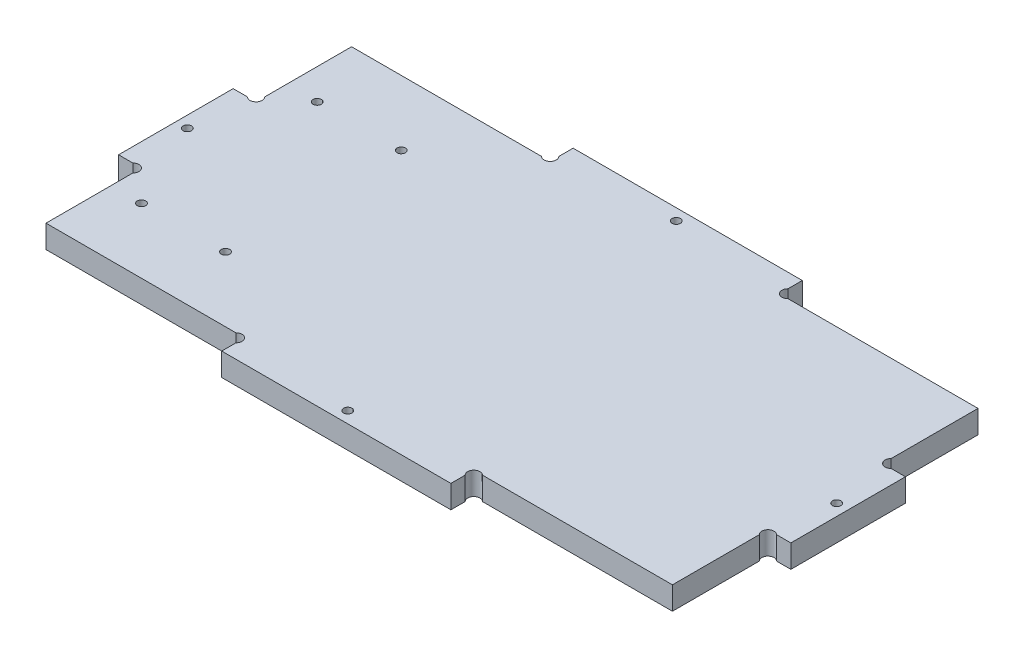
from build123d import *

# Parameters (mm, degrees)
ESQUISSE1_R        = 1.1
BOSS_EXTRU_1_DEPTH = 6


with BuildPart() as part:
    # Esquisse1 → Boss.-Extru.1 (new body)
    with BuildSketch(Plane(origin=(0, 0, 0), x_dir=(1, 0, 0), z_dir=(0, 1, 0))):
        with BuildLine():
            Line((120.2627417, 146), (170, 146))
            Line((170, 146), (170, 123.2627417))
            ThreePointArc((170, 123.2627417), (170, 121), (172.2627417, 121))
            Line((172.2627417, 121), (176, 121))
            Line((176, 121), (176, 91))
            Line((176, 91), (172.2627417, 91))
            ThreePointArc((172.2627417, 91), (170, 91), (170, 88.7372583))
            Line((170, 88.7372583), (170, 66))
            Line((170, 66), (120.2627417, 66))
            ThreePointArc((120.2627417, 66), (118, 66), (118, 63.7372583))
            Line((118, 63.7372583), (118, 60))
            Line((118, 60), (58, 60))
            Line((58, 60), (58, 63.7372583))
            ThreePointArc((58, 63.7372583), (58, 66), (55.7372583, 66))
            Line((55.7372583, 66), (6, 66))
            Line((6, 66), (6, 88.7372583))
            ThreePointArc((6, 88.7372583), (6, 91), (3.7372583, 91))
            Line((3.7372583, 91), (0, 91))
            Line((0, 91), (0, 121))
            Line((0, 121), (3.7372583, 121))
            ThreePointArc((3.7372583, 121), (6, 121), (6, 123.2627417))
            Line((6, 123.2627417), (6, 146))
            Line((6, 146), (55.7372583, 146))
            ThreePointArc((55.7372583, 146), (58, 146), (58, 148.2627417))
            Line((58, 148.2627417), (58, 152))
            Line((58, 152), (118, 152))
            Line((118, 152), (118, 148.2627417))
            ThreePointArc((118, 148.2627417), (118, 146), (120.2627417, 146))
        make_face()
        with Locations(Location((88, 149, 0), (0, 0, 270))):
            Circle(ESQUISSE1_R, mode=Mode.SUBTRACT)
        with Locations(Location((88, 63, 0), (0, 0, 90))):
            Circle(ESQUISSE1_R, mode=Mode.SUBTRACT)
        with Locations(Location((3, 106, 0), (0, 0, 270))):
            Circle(ESQUISSE1_R, mode=Mode.SUBTRACT)
        with Locations(Location((173, 106, 0), (0, 0, 90))):
            Circle(ESQUISSE1_R, mode=Mode.SUBTRACT)
        with Locations(Location((14, 83, 0), (0, 0, 270))):
            Circle(ESQUISSE1_R, mode=Mode.SUBTRACT)
        with Locations(Location((14, 129, 0), (0, 0, 90))):
            Circle(ESQUISSE1_R, mode=Mode.SUBTRACT)
        with Locations(Location((36, 129, 0), (0, 0, 270))):
            Circle(ESQUISSE1_R, mode=Mode.SUBTRACT)
        with Locations(Location((36, 83, 0), (0, 0, 90))):
            Circle(ESQUISSE1_R, mode=Mode.SUBTRACT)
    extrude(amount=BOSS_EXTRU_1_DEPTH)


solid = part.part
